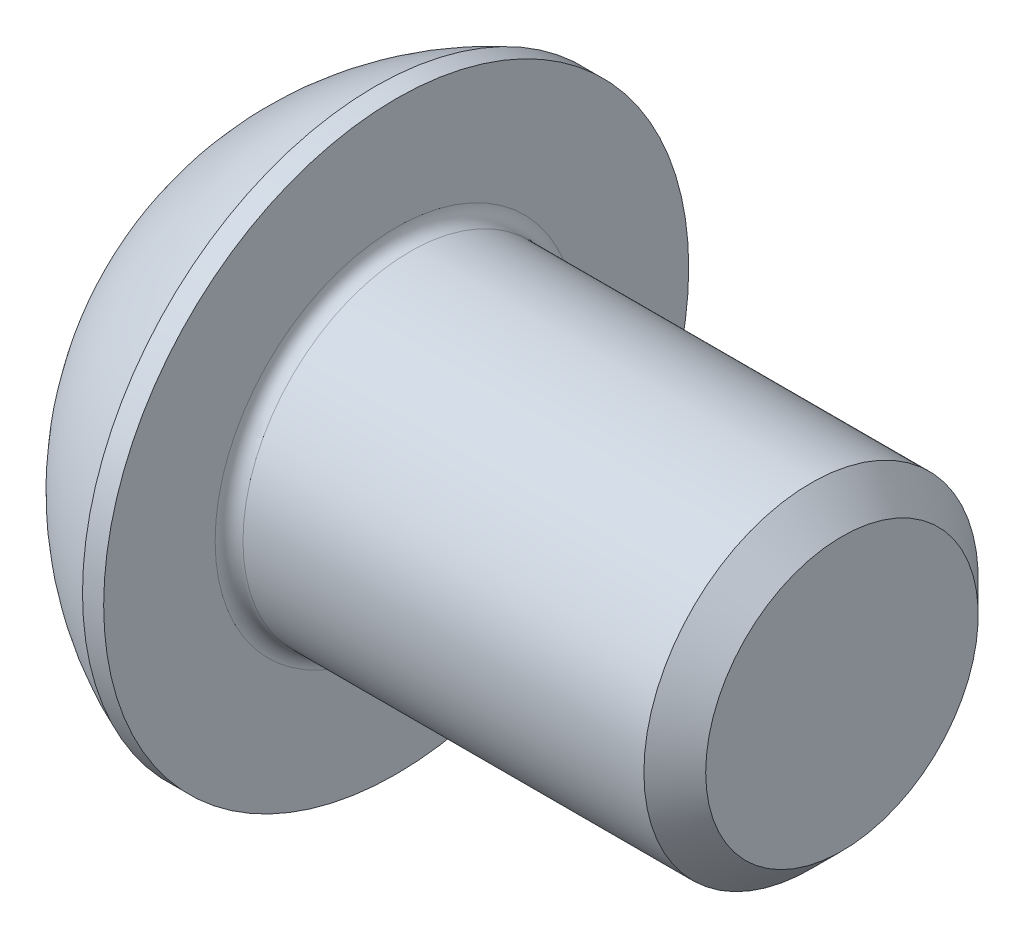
from build123d import *

# Parameters (mm, degrees)
FILLET1_R   = 0.25
HEX_2_DEPTH = 2.08


with BuildPart() as part:
    # BodySke → BaseBody (revolve)
    with BuildSketch(Plane.XY, mode=Mode.PRIVATE) as basebody_sk:
        with BuildLine():
            Line((11.3, 0), (11.3, 2.4455))
            Line((11.3, 2.4455), (10.7455, 3))
            Line((10.7455, 3), (3.3, 3))
            Line((3.3, 3), (3.3, 5.25))
            Line((3.3, 5.25), (2.92, 5.25))
            ThreePointArc((2.92, 5.25), (1.224500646, 4.199464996), (0, 2.625))
            Line((0, 2.625), (0, 0))
            Line((0, 0), (11.3, 0))
        make_face()
    revolve(basebody_sk.sketch.rotate(Axis((0, 0, 0), (1, 0, 0)), 90), axis=Axis((0, 0, 0), (1, 0, 0)))

    # Fillet1
    fillet1_edges = [part.edges().sort_by_distance(p)[0] for p in [
        (3.3, 0, -3),
    ]]
    fillet(fillet1_edges, radius=FILLET1_R)

    # Sketch2 → PreBroach (revolve, cut)
    with BuildSketch(Plane.XY):
        Polygon((0, 2), (2.08, 2), (3.234700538, 0), (0, 0), align=None)
    revolve(axis=Axis((0, 0, 0), (1, 0, 0)), mode=Mode.SUBTRACT)

    # Sketch3 → Hex 2 (cut)
    with BuildSketch(Plane(origin=(0, 0, 0), x_dir=(0, 0, -1), z_dir=(1, 0, 0))):
        Polygon((-2, -1.154700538), (-2, 1.154700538), (0, 2.309401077), (2, 1.154700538), (2, -1.154700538), (0, -2.309401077), align=None)
    extrude(amount=HEX_2_DEPTH, mode=Mode.SUBTRACT)


solid = part.part
